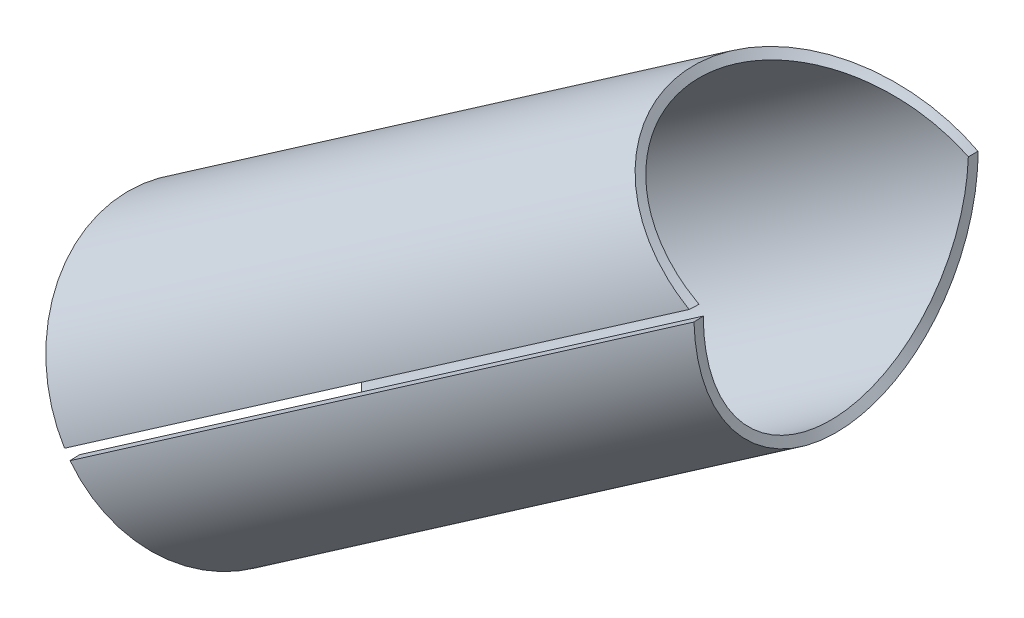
ISO-10303-21;
HEADER;
FILE_DESCRIPTION(('STEP AP214'),'2;1');
FILE_NAME('part.step','',(''),(''),'','','');
FILE_SCHEMA(('AUTOMOTIVE_DESIGN { 1 0 10303 214 1 1 1 1 }'));
ENDSEC;
DATA;
#1=APPLICATION_CONTEXT('core data for automotive mechanical design processes');
#2=APPLICATION_PROTOCOL_DEFINITION('international standard','automotive_design',2000,#1);
#3=PRODUCT_CONTEXT('',#1,'mechanical');
#4=PRODUCT('Part','Part','',(#3));
#5=PRODUCT_RELATED_PRODUCT_CATEGORY('part','',(#4));
#6=PRODUCT_DEFINITION_FORMATION('','',#4);
#7=PRODUCT_DEFINITION_CONTEXT('part definition',#1,'design');
#8=PRODUCT_DEFINITION('design','',#6,#7);
#9=PRODUCT_DEFINITION_SHAPE('','',#8);
#10=(LENGTH_UNIT() NAMED_UNIT(*) SI_UNIT(.MILLI.,.METRE.));
#11=(NAMED_UNIT(*) PLANE_ANGLE_UNIT() SI_UNIT($,.RADIAN.));
#12=(NAMED_UNIT(*) SI_UNIT($,.STERADIAN.) SOLID_ANGLE_UNIT());
#13=UNCERTAINTY_MEASURE_WITH_UNIT(LENGTH_MEASURE(1.E-05),#10,'distance_accuracy_value','');
#14=(GEOMETRIC_REPRESENTATION_CONTEXT(3) GLOBAL_UNCERTAINTY_ASSIGNED_CONTEXT((#13)) GLOBAL_UNIT_ASSIGNED_CONTEXT((#10,
#11,#12)) REPRESENTATION_CONTEXT('',''));
#15=CARTESIAN_POINT('',(0.,0.,0.));
#16=DIRECTION('',(0.,0.,1.));
#17=DIRECTION('',(1.,0.,0.));
#18=AXIS2_PLACEMENT_3D('',#15,#16,#17);
#19=CARTESIAN_POINT('',(-0.499999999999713,0.261949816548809,14.6683564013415));
#20=CARTESIAN_POINT('',(-1.03427774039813,0.541893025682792,14.6501434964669));
#21=CARTESIAN_POINT('',(-1.51605350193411,0.794596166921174,14.6047467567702));
#22=CARTESIAN_POINT('',(-2.37377469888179,1.24394241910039,14.4900592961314));
#23=CARTESIAN_POINT('',(-2.7497042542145,1.4406270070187,14.4207825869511));
#24=CARTESIAN_POINT('',(-3.15408911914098,1.65241661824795,14.3342000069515));
#25=CARTESIAN_POINT('',(-3.23176083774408,1.69311341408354,14.31687152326));
#26=CARTESIAN_POINT('',(-3.38742239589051,1.7746733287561,14.2808406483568));
#27=CARTESIAN_POINT('',(-3.46455492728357,1.81509122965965,14.2623165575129));
#28=CARTESIAN_POINT('',(-3.6938513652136,1.93524950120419,14.2053054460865));
#29=CARTESIAN_POINT('',(-3.84391368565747,2.01389381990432,14.1653800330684));
#30=CARTESIAN_POINT('',(-4.28565951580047,2.24539232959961,14.0405311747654));
#31=CARTESIAN_POINT('',(-4.56889596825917,2.39380351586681,13.950542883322));
#32=CARTESIAN_POINT('',(-5.11281457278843,2.67873626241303,13.7605108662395));
#33=CARTESIAN_POINT('',(-5.37349793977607,2.81525957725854,13.6604676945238));
#34=CARTESIAN_POINT('',(-5.87245514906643,3.07662566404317,13.4535281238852));
#35=CARTESIAN_POINT('',(-6.11316013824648,3.20275145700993,13.3456792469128));
#36=CARTESIAN_POINT('',(-6.81793295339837,3.57202081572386,13.0075686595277));
#37=CARTESIAN_POINT('',(-7.26087454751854,3.80405046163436,12.7643139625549));
#38=CARTESIAN_POINT('',(-7.88499785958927,4.13097307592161,12.3813056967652));
#39=CARTESIAN_POINT('',(-8.0858587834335,4.23620421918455,12.2509294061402));
#40=CARTESIAN_POINT('',(-8.47674296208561,4.44102207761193,11.9837692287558));
#41=CARTESIAN_POINT('',(-8.66702830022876,4.54073026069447,11.8467743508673));
#42=CARTESIAN_POINT('',(-9.22237454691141,4.83169550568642,11.4268314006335));
#43=CARTESIAN_POINT('',(-9.57191100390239,5.01477205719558,11.1349409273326));
#44=CARTESIAN_POINT('',(-10.2297649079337,5.35936973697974,10.5338081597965));
#45=CARTESIAN_POINT('',(-10.5376027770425,5.52071119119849,10.2252596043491));
#46=CARTESIAN_POINT('',(-11.1217614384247,5.82707888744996,9.58631226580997));
#47=CARTESIAN_POINT('',(-11.3968870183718,5.97141668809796,9.256941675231));
#48=CARTESIAN_POINT('',(-12.1710090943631,6.37732378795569,8.24500607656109));
#49=CARTESIAN_POINT('',(-12.6186467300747,6.61163630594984,7.5387135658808));
#50=CARTESIAN_POINT('',(-13.187921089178,6.90936506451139,6.45379169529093));
#51=CARTESIAN_POINT('',(-13.3606760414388,6.99969056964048,6.0878813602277));
#52=CARTESIAN_POINT('',(-13.6725549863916,7.16304886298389,5.35088506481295));
#53=CARTESIAN_POINT('',(-13.8126142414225,7.23654952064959,4.97771468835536));
#54=CARTESIAN_POINT('',(-14.4352972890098,7.56338869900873,3.0895739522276));
#55=CARTESIAN_POINT('',(-14.6813449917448,7.69175467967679,1.51385726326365));
#56=CARTESIAN_POINT('',(-14.6756582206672,7.68854121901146,-0.433843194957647));
#57=CARTESIAN_POINT('',(-14.6589586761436,7.67987441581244,-0.823000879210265));
#58=CARTESIAN_POINT('',(-14.5941291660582,7.64614862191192,-1.60252277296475));
#59=CARTESIAN_POINT('',(-14.5460023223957,7.62107994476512,-1.99223912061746));
#60=CARTESIAN_POINT('',(-14.3542405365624,7.5209027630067,-3.15738802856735));
#61=CARTESIAN_POINT('',(-14.1631599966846,7.42073018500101,-3.92884152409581));
#62=CARTESIAN_POINT('',(-13.7818123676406,7.22058056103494,-5.06206826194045));
#63=CARTESIAN_POINT('',(-13.6389245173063,7.14557175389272,-5.43581208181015));
#64=CARTESIAN_POINT('',(-13.3218231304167,6.97928481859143,-6.17259035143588));
#65=CARTESIAN_POINT('',(-13.1476236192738,6.88805199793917,-6.53573080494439));
#66=CARTESIAN_POINT('',(-12.5742834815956,6.58775071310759,-7.61302317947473));
#67=CARTESIAN_POINT('',(-12.1254624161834,6.35253985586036,-8.31221973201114));
#68=CARTESIAN_POINT('',(-11.3526046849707,5.94759175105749,-9.31166132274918));
#69=CARTESIAN_POINT('',(-11.0788155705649,5.80423027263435,-9.63616781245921));
#70=CARTESIAN_POINT('',(-10.4938505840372,5.49782418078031,-10.2700557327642));
#71=CARTESIAN_POINT('',(-10.1835266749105,5.33519561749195,-10.5784350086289));
#72=CARTESIAN_POINT('',(-9.52462585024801,4.98992827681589,-11.1754260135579));
#73=CARTESIAN_POINT('',(-9.17347287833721,4.80605869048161,-11.4662187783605));
#74=CARTESIAN_POINT('',(-8.42731374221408,4.41520058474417,-12.0252444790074));
#75=CARTESIAN_POINT('',(-8.03315996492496,4.20863351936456,-12.2929697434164));
#76=CARTESIAN_POINT('',(-7.19751404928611,3.7707574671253,-12.8002190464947));
#77=CARTESIAN_POINT('',(-6.75038744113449,3.53659916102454,-13.0430114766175));
#78=CARTESIAN_POINT('',(-6.03537810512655,3.16200567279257,-13.3810936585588));
#79=CARTESIAN_POINT('',(-5.7896638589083,3.03326117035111,-13.4894248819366));
#80=CARTESIAN_POINT('',(-5.41006963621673,2.83438773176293,-13.6440467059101));
#81=CARTESIAN_POINT('',(-5.28217948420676,2.76738747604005,-13.6940983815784));
#82=CARTESIAN_POINT('',(-5.02027660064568,2.63020659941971,-13.7922568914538));
#83=CARTESIAN_POINT('',(-4.88595232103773,2.55986027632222,-13.8404634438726));
#84=CARTESIAN_POINT('',(-4.1973905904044,2.19923927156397,-14.0758599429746));
#85=CARTESIAN_POINT('',(-3.5921666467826,1.88205741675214,-14.2463770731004));
#86=CARTESIAN_POINT('',(-2.85037109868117,1.49332219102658,-14.3976760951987));
#87=CARTESIAN_POINT('',(-2.76710619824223,1.44969046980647,-14.4139203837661));
#88=CARTESIAN_POINT('',(-2.59889625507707,1.36155814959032,-14.4451980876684));
#89=CARTESIAN_POINT('',(-2.51049320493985,1.31526755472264,-14.4608930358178));
#90=CARTESIAN_POINT('',(-2.22331691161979,1.16495084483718,-14.5087771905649));
#91=CARTESIAN_POINT('',(-2.00634307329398,1.05142408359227,-14.5411136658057));
#92=CARTESIAN_POINT('',(-1.2784017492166,0.670245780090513,-14.6292240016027));
#93=CARTESIAN_POINT('',(-0.690307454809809,0.361658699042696,-14.6768756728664));
#94=CARTESIAN_POINT('',(0.,1.86879316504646E-13,-14.6768756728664));
#95=CARTESIAN_POINT('',(-0.480606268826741,0.233941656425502,13.6689368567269));
#96=CARTESIAN_POINT('',(-0.994157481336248,0.483953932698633,13.651964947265));
#97=CARTESIAN_POINT('',(-1.45723890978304,0.70965694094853,13.6096612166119));
#98=CARTESIAN_POINT('',(-2.28169171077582,1.11095743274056,13.5027879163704));
#99=CARTESIAN_POINT('',(-2.64304835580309,1.28659602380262,13.4382313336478));
#100=CARTESIAN_POINT('',(-3.03175030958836,1.47573659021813,13.3575480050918));
#101=CARTESIAN_POINT('',(-3.10640919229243,1.51208228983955,13.3414001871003));
#102=CARTESIAN_POINT('',(-3.25603275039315,1.58492220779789,13.3078242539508));
#103=CARTESIAN_POINT('',(-3.3301732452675,1.62101905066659,13.2905622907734));
#104=CARTESIAN_POINT('',(-3.5505749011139,1.72833160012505,13.2374355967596));
#105=CARTESIAN_POINT('',(-3.69481583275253,1.79856874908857,13.2002304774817));
#106=CARTESIAN_POINT('',(-4.119425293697,2.00531914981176,13.0838881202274));
#107=CARTESIAN_POINT('',(-4.39167496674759,2.13786338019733,13.000031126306));
#108=CARTESIAN_POINT('',(-4.91449717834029,2.39232900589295,12.8229468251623));
#109=CARTESIAN_POINT('',(-5.16507084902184,2.51425203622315,12.7297200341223));
#110=CARTESIAN_POINT('',(-5.64467596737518,2.74767009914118,12.5368801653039));
#111=CARTESIAN_POINT('',(-5.87604396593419,2.86031153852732,12.4363795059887));
#112=CARTESIAN_POINT('',(-6.55347918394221,3.19010031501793,12.1213058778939));
#113=CARTESIAN_POINT('',(-6.97924106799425,3.39731925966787,11.8946251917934));
#114=CARTESIAN_POINT('',(-7.57915798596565,3.68928333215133,11.537712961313));
#115=CARTESIAN_POINT('',(-7.77222801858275,3.78326297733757,11.4162197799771));
#116=CARTESIAN_POINT('',(-8.14794971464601,3.96618338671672,11.1672623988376));
#117=CARTESIAN_POINT('',(-8.33085380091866,4.05523166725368,11.0396015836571));
#118=CARTESIAN_POINT('',(-8.86465895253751,4.31508755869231,10.6482711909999));
#119=CARTESIAN_POINT('',(-9.20063922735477,4.47858645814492,10.3762684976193));
#120=CARTESIAN_POINT('',(-9.83297829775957,4.78633596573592,9.81609354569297));
#121=CARTESIAN_POINT('',(-10.128873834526,4.93043046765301,9.52856775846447));
#122=CARTESIAN_POINT('',(-10.6903640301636,5.20406067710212,8.93315470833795));
#123=CARTESIAN_POINT('',(-10.9548118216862,5.33297776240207,8.6262255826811));
#124=CARTESIAN_POINT('',(-11.698896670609,5.69550551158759,7.68323760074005));
#125=CARTESIAN_POINT('',(-12.1291781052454,5.90475244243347,7.0250679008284));
#126=CARTESIAN_POINT('',(-12.6763881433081,6.1706162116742,6.01406652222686));
#127=CARTESIAN_POINT('',(-12.8424481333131,6.25127294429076,5.67308726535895));
#128=CARTESIAN_POINT('',(-13.1422312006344,6.39716253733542,4.98630576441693));
#129=CARTESIAN_POINT('',(-13.2768539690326,6.46281189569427,4.63856112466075));
#130=CARTESIAN_POINT('',(-13.8753650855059,6.75474230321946,2.87906770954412));
#131=CARTESIAN_POINT('',(-14.1118863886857,6.86935038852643,1.41071151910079));
#132=CARTESIAN_POINT('',(-14.1064276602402,6.8664662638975,-0.404283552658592));
#133=CARTESIAN_POINT('',(-14.0903732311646,6.85873112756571,-0.76692621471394));
#134=CARTESIAN_POINT('',(-14.0280506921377,6.8286258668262,-1.49333585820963));
#135=CARTESIAN_POINT('',(-13.9817859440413,6.80624640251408,-1.85649911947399));
#136=CARTESIAN_POINT('',(-13.7974529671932,6.71679780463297,-2.94226131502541));
#137=CARTESIAN_POINT('',(-13.6137860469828,6.62733187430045,-3.66115229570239));
#138=CARTESIAN_POINT('',(-13.247241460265,6.44856060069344,-4.71716731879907));
#139=CARTESIAN_POINT('',(-13.1099006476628,6.38156274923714,-5.06544633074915));
#140=CARTESIAN_POINT('',(-12.8051038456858,6.23304592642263,-5.75202466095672));
#141=CARTESIAN_POINT('',(-12.6376601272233,6.15156972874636,-6.09042276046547));
#142=CARTESIAN_POINT('',(-12.0865561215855,5.88338156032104,-7.09431447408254));
#143=CARTESIAN_POINT('',(-11.655146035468,5.67331540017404,-7.74587169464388));
#144=CARTESIAN_POINT('',(-10.9122670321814,5.3116621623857,-8.67721694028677));
#145=CARTESIAN_POINT('',(-10.6490950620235,5.18363381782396,-8.97961337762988));
#146=CARTESIAN_POINT('',(-10.0868175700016,4.9099926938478,-9.57031172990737));
#147=CARTESIAN_POINT('',(-9.78853193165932,4.76474963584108,-9.85767977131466));
#148=CARTESIAN_POINT('',(-9.15519041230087,4.4563946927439,-10.4139951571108));
#149=CARTESIAN_POINT('',(-8.81765460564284,4.29219082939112,-10.6849749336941));
#150=CARTESIAN_POINT('',(-8.10043535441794,3.94312730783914,-11.2059117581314));
#151=CARTESIAN_POINT('',(-7.72157203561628,3.75864251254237,-11.4553957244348));
#152=CARTESIAN_POINT('',(-6.91834130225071,3.36758002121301,-11.9280839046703));
#153=CARTESIAN_POINT('',(-6.48855469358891,3.15846390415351,-12.1543338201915));
#154=CARTESIAN_POINT('',(-5.80127876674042,2.82392262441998,-12.4693809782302));
#155=CARTESIAN_POINT('',(-5.565095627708,2.70894281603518,-12.5703311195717));
#156=CARTESIAN_POINT('',(-5.20022503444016,2.53133304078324,-12.7144178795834));
#157=CARTESIAN_POINT('',(-5.0772953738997,2.47149665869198,-12.7610593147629));
#158=CARTESIAN_POINT('',(-4.82555008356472,2.3489852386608,-12.8525298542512));
#159=CARTESIAN_POINT('',(-4.69643506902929,2.28616206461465,-12.8974518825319));
#160=CARTESIAN_POINT('',(-4.03457719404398,1.96410640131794,-13.1168097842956));
#161=CARTESIAN_POINT('',(-3.45283170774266,1.6808318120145,-13.2757088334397));
#162=CARTESIAN_POINT('',(-2.7398119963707,1.33365425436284,-13.4166991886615));
#163=CARTESIAN_POINT('',(-2.65977702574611,1.2946871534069,-13.4318366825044));
#164=CARTESIAN_POINT('',(-2.49809174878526,1.21597766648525,-13.4609832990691));
#165=CARTESIAN_POINT('',(-2.4131168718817,1.17463799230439,-13.4756088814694));
#166=CARTESIAN_POINT('',(-2.13707511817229,1.0404016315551,-13.5202304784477));
#167=CARTESIAN_POINT('',(-1.92851249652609,0.939022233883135,-13.5503637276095));
#168=CARTESIAN_POINT('',(-1.22880011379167,0.598611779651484,-13.6324707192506));
#169=CARTESIAN_POINT('',(-0.663525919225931,0.322986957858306,-13.6768756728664));
#170=CARTESIAN_POINT('',(0.,1.78761797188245E-13,-13.6768756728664));
#171=B_SPLINE_SURFACE_WITH_KNOTS('',1,3,((#19,#20,#21,#22,#23,#24,#25,#26,#27,#28,#29,#30,#31,
#32,#33,#34,#35,#36,#37,#38,#39,#40,#41,#42,#43,#44,#45,#46,#47,#48,#49,#50,#51,#52,#53,#54,#55,
#56,#57,#58,#59,#60,#61,#62,#63,#64,#65,#66,#67,#68,#69,#70,#71,#72,#73,#74,#75,#76,#77,#78,#79,
#80,#81,#82,#83,#84,#85,#86,#87,#88,#89,#90,#91,#92,#93,#94),(#95,#96,#97,#98,#99,#100,#101,
#102,#103,#104,#105,#106,#107,#108,#109,#110,#111,#112,#113,#114,#115,#116,#117,#118,#119,#120,
#121,#122,#123,#124,#125,#126,#127,#128,#129,#130,#131,#132,#133,#134,#135,#136,#137,#138,#139,
#140,#141,#142,#143,#144,#145,#146,#147,#148,#149,#150,#151,#152,#153,#154,#155,#156,#157,#158,
#159,#160,#161,#162,#163,#164,#165,#166,#167,#168,#169,#170)),.UNSPECIFIED.,.F.,.F.,.F.,(2,2),
(4,2,2,2,2,2,2,2,2,2,2,2,2,2,2,2,2,2,2,2,2,2,2,2,2,2,2,2,2,2,2,2,2,2,2,2,2,4),(0.,1.),(0.,
0.015625,0.03125,0.03515625,0.0390625,0.046875,0.0625,0.078125,0.09375,0.125,0.140625,0.15625,
0.1875,0.21875,0.25,0.3125,0.34375,0.375,0.5,0.53125,0.5625,0.625,0.65625,0.6875,0.75,0.78125,
0.8125,0.84375,0.875,0.90625,0.921875,0.9296875,0.9375,0.96875,0.97265625,0.9765625,0.984375,
1.),.UNSPECIFIED.);
#172=CARTESIAN_POINT('',(-0.499999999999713,0.261949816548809,14.6683564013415));
#173=CARTESIAN_POINT('',(-0.480606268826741,0.233941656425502,13.6689368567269));
#174=B_SPLINE_CURVE_WITH_KNOTS('',1,(#172,#173),.UNSPECIFIED.,.F.,.F.,(2,2),(0.,1.),.UNSPECIFIED.);
#175=CARTESIAN_POINT('',(-0.480606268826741,0.233941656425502,13.6689368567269));
#176=VERTEX_POINT('',#175);
#177=CARTESIAN_POINT('',(-0.499999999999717,0.261949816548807,14.6683564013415));
#178=VERTEX_POINT('',#177);
#179=EDGE_CURVE('E13',#176,#178,#174,.F.);
#180=CARTESIAN_POINT('',(-0.480606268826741,0.233941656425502,13.6689368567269));
#181=CARTESIAN_POINT('',(-0.994157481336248,0.483953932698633,13.651964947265));
#182=CARTESIAN_POINT('',(-1.45723890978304,0.70965694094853,13.6096612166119));
#183=CARTESIAN_POINT('',(-2.28169171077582,1.11095743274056,13.5027879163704));
#184=CARTESIAN_POINT('',(-2.64304835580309,1.28659602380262,13.4382313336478));
#185=CARTESIAN_POINT('',(-3.03175030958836,1.47573659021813,13.3575480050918));
#186=CARTESIAN_POINT('',(-3.10640919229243,1.51208228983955,13.3414001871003));
#187=CARTESIAN_POINT('',(-3.25603275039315,1.58492220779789,13.3078242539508));
#188=CARTESIAN_POINT('',(-3.3301732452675,1.62101905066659,13.2905622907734));
#189=CARTESIAN_POINT('',(-3.5505749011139,1.72833160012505,13.2374355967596));
#190=CARTESIAN_POINT('',(-3.69481583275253,1.79856874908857,13.2002304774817));
#191=CARTESIAN_POINT('',(-4.119425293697,2.00531914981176,13.0838881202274));
#192=CARTESIAN_POINT('',(-4.39167496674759,2.13786338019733,13.000031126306));
#193=CARTESIAN_POINT('',(-4.91449717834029,2.39232900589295,12.8229468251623));
#194=CARTESIAN_POINT('',(-5.16507084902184,2.51425203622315,12.7297200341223));
#195=CARTESIAN_POINT('',(-5.64467596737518,2.74767009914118,12.5368801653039));
#196=CARTESIAN_POINT('',(-5.87604396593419,2.86031153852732,12.4363795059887));
#197=CARTESIAN_POINT('',(-6.55347918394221,3.19010031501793,12.1213058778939));
#198=CARTESIAN_POINT('',(-6.97924106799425,3.39731925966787,11.8946251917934));
#199=CARTESIAN_POINT('',(-7.57915798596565,3.68928333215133,11.537712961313));
#200=CARTESIAN_POINT('',(-7.77222801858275,3.78326297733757,11.4162197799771));
#201=CARTESIAN_POINT('',(-8.14794971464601,3.96618338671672,11.1672623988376));
#202=CARTESIAN_POINT('',(-8.33085380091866,4.05523166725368,11.0396015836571));
#203=CARTESIAN_POINT('',(-8.86465895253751,4.31508755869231,10.6482711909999));
#204=CARTESIAN_POINT('',(-9.20063922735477,4.47858645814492,10.3762684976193));
#205=CARTESIAN_POINT('',(-9.83297829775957,4.78633596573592,9.81609354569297));
#206=CARTESIAN_POINT('',(-10.128873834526,4.93043046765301,9.52856775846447));
#207=CARTESIAN_POINT('',(-10.6903640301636,5.20406067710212,8.93315470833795));
#208=CARTESIAN_POINT('',(-10.9548118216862,5.33297776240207,8.6262255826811));
#209=CARTESIAN_POINT('',(-11.698896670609,5.69550551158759,7.68323760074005));
#210=CARTESIAN_POINT('',(-12.1291781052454,5.90475244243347,7.0250679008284));
#211=CARTESIAN_POINT('',(-12.6763881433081,6.1706162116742,6.01406652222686));
#212=CARTESIAN_POINT('',(-12.8424481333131,6.25127294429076,5.67308726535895));
#213=CARTESIAN_POINT('',(-13.1422312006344,6.39716253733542,4.98630576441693));
#214=CARTESIAN_POINT('',(-13.2768539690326,6.46281189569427,4.63856112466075));
#215=CARTESIAN_POINT('',(-13.8753650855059,6.75474230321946,2.87906770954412));
#216=CARTESIAN_POINT('',(-14.1118863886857,6.86935038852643,1.41071151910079));
#217=CARTESIAN_POINT('',(-14.1064276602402,6.8664662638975,-0.404283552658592));
#218=CARTESIAN_POINT('',(-14.0903732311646,6.85873112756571,-0.76692621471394));
#219=CARTESIAN_POINT('',(-14.0280506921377,6.8286258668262,-1.49333585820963));
#220=CARTESIAN_POINT('',(-13.9817859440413,6.80624640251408,-1.85649911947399));
#221=CARTESIAN_POINT('',(-13.7974529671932,6.71679780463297,-2.94226131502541));
#222=CARTESIAN_POINT('',(-13.6137860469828,6.62733187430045,-3.66115229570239));
#223=CARTESIAN_POINT('',(-13.247241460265,6.44856060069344,-4.71716731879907));
#224=CARTESIAN_POINT('',(-13.1099006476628,6.38156274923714,-5.06544633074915));
#225=CARTESIAN_POINT('',(-12.8051038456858,6.23304592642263,-5.75202466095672));
#226=CARTESIAN_POINT('',(-12.6376601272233,6.15156972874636,-6.09042276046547));
#227=CARTESIAN_POINT('',(-12.0865561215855,5.88338156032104,-7.09431447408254));
#228=CARTESIAN_POINT('',(-11.655146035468,5.67331540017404,-7.74587169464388));
#229=CARTESIAN_POINT('',(-10.9122670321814,5.3116621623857,-8.67721694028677));
#230=CARTESIAN_POINT('',(-10.6490950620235,5.18363381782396,-8.97961337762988));
#231=CARTESIAN_POINT('',(-10.0868175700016,4.9099926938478,-9.57031172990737));
#232=CARTESIAN_POINT('',(-9.78853193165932,4.76474963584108,-9.85767977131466));
#233=CARTESIAN_POINT('',(-9.15519041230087,4.4563946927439,-10.4139951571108));
#234=CARTESIAN_POINT('',(-8.81765460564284,4.29219082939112,-10.6849749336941));
#235=CARTESIAN_POINT('',(-8.10043535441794,3.94312730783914,-11.2059117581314));
#236=CARTESIAN_POINT('',(-7.72157203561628,3.75864251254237,-11.4553957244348));
#237=CARTESIAN_POINT('',(-6.91834130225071,3.36758002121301,-11.9280839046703));
#238=CARTESIAN_POINT('',(-6.48855469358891,3.15846390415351,-12.1543338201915));
#239=CARTESIAN_POINT('',(-5.80127876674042,2.82392262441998,-12.4693809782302));
#240=CARTESIAN_POINT('',(-5.565095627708,2.70894281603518,-12.5703311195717));
#241=CARTESIAN_POINT('',(-5.20022503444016,2.53133304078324,-12.7144178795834));
#242=CARTESIAN_POINT('',(-5.0772953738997,2.47149665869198,-12.7610593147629));
#243=CARTESIAN_POINT('',(-4.82555008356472,2.3489852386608,-12.8525298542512));
#244=CARTESIAN_POINT('',(-4.69643506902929,2.28616206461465,-12.8974518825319));
#245=CARTESIAN_POINT('',(-4.03457719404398,1.96410640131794,-13.1168097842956));
#246=CARTESIAN_POINT('',(-3.45283170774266,1.6808318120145,-13.2757088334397));
#247=CARTESIAN_POINT('',(-2.7398119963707,1.33365425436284,-13.4166991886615));
#248=CARTESIAN_POINT('',(-2.65977702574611,1.2946871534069,-13.4318366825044));
#249=CARTESIAN_POINT('',(-2.49809174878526,1.21597766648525,-13.4609832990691));
#250=CARTESIAN_POINT('',(-2.4131168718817,1.17463799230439,-13.4756088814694));
#251=CARTESIAN_POINT('',(-2.13707511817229,1.0404016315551,-13.5202304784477));
#252=CARTESIAN_POINT('',(-1.92851249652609,0.939022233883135,-13.5503637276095));
#253=CARTESIAN_POINT('',(-1.22880011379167,0.598611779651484,-13.6324707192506));
#254=CARTESIAN_POINT('',(-0.663525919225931,0.322986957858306,-13.6768756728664));
#255=CARTESIAN_POINT('',(0.,1.78761797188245E-13,-13.6768756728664));
#256=B_SPLINE_CURVE_WITH_KNOTS('',3,(#180,#181,#182,#183,#184,#185,#186,#187,#188,#189,#190,
#191,#192,#193,#194,#195,#196,#197,#198,#199,#200,#201,#202,#203,#204,#205,#206,#207,#208,#209,
#210,#211,#212,#213,#214,#215,#216,#217,#218,#219,#220,#221,#222,#223,#224,#225,#226,#227,#228,
#229,#230,#231,#232,#233,#234,#235,#236,#237,#238,#239,#240,#241,#242,#243,#244,#245,#246,#247,
#248,#249,#250,#251,#252,#253,#254,#255),.UNSPECIFIED.,.F.,.F.,(4,2,2,2,2,2,2,2,2,2,2,2,2,2,2,2,
2,2,2,2,2,2,2,2,2,2,2,2,2,2,2,2,2,2,2,2,2,4),(0.,0.015625,0.03125,0.03515625,0.0390625,0.046875,
0.0625,0.078125,0.09375,0.125,0.140625,0.15625,0.1875,0.21875,0.25,0.3125,0.34375,0.375,0.5,
0.53125,0.5625,0.625,0.65625,0.6875,0.75,0.78125,0.8125,0.84375,0.875,0.90625,0.921875,
0.9296875,0.9375,0.96875,0.97265625,0.9765625,0.984375,1.),.UNSPECIFIED.);
#257=CARTESIAN_POINT('',(0.,1.84858021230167E-13,-13.6768756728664));
#258=VERTEX_POINT('',#257);
#259=EDGE_CURVE('E165',#176,#258,#256,.T.);
#260=CARTESIAN_POINT('',(0.,1.78761797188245E-13,-13.6768756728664));
#261=CARTESIAN_POINT('',(0.,1.86879316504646E-13,-14.6768756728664));
#262=B_SPLINE_CURVE_WITH_KNOTS('',1,(#260,#261),.UNSPECIFIED.,.F.,.F.,(2,2),(0.,1.),.UNSPECIFIED.);
#263=CARTESIAN_POINT('',(-4.11096626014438E-07,2.15377680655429E-07,-14.6768756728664));
#264=VERTEX_POINT('',#263);
#265=EDGE_CURVE('E49',#258,#264,#262,.T.);
#266=CARTESIAN_POINT('',(0.,1.86879316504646E-13,-14.6768756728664));
#267=CARTESIAN_POINT('',(-0.690307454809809,0.361658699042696,-14.6768756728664));
#268=CARTESIAN_POINT('',(-1.2784017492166,0.670245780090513,-14.6292240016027));
#269=CARTESIAN_POINT('',(-2.00634307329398,1.05142408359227,-14.5411136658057));
#270=CARTESIAN_POINT('',(-2.22331691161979,1.16495084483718,-14.5087771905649));
#271=CARTESIAN_POINT('',(-2.51049320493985,1.31526755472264,-14.4608930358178));
#272=CARTESIAN_POINT('',(-2.59889625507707,1.36155814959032,-14.4451980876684));
#273=CARTESIAN_POINT('',(-2.76710619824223,1.44969046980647,-14.4139203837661));
#274=CARTESIAN_POINT('',(-2.85037109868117,1.49332219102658,-14.3976760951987));
#275=CARTESIAN_POINT('',(-3.5921666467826,1.88205741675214,-14.2463770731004));
#276=CARTESIAN_POINT('',(-4.1973905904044,2.19923927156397,-14.0758599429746));
#277=CARTESIAN_POINT('',(-4.88595232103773,2.55986027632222,-13.8404634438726));
#278=CARTESIAN_POINT('',(-5.02027660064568,2.63020659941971,-13.7922568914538));
#279=CARTESIAN_POINT('',(-5.28217948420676,2.76738747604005,-13.6940983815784));
#280=CARTESIAN_POINT('',(-5.41006963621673,2.83438773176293,-13.6440467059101));
#281=CARTESIAN_POINT('',(-5.7896638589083,3.03326117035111,-13.4894248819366));
#282=CARTESIAN_POINT('',(-6.03537810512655,3.16200567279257,-13.3810936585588));
#283=CARTESIAN_POINT('',(-6.75038744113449,3.53659916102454,-13.0430114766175));
#284=CARTESIAN_POINT('',(-7.19751404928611,3.7707574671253,-12.8002190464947));
#285=CARTESIAN_POINT('',(-8.03315996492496,4.20863351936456,-12.2929697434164));
#286=CARTESIAN_POINT('',(-8.42731374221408,4.41520058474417,-12.0252444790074));
#287=CARTESIAN_POINT('',(-9.17347287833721,4.80605869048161,-11.4662187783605));
#288=CARTESIAN_POINT('',(-9.52462585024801,4.98992827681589,-11.1754260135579));
#289=CARTESIAN_POINT('',(-10.1835266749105,5.33519561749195,-10.5784350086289));
#290=CARTESIAN_POINT('',(-10.4938505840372,5.49782418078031,-10.2700557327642));
#291=CARTESIAN_POINT('',(-11.0788155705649,5.80423027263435,-9.63616781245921));
#292=CARTESIAN_POINT('',(-11.3526046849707,5.94759175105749,-9.31166132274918));
#293=CARTESIAN_POINT('',(-12.1254624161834,6.35253985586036,-8.31221973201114));
#294=CARTESIAN_POINT('',(-12.5742834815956,6.58775071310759,-7.61302317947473));
#295=CARTESIAN_POINT('',(-13.1476236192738,6.88805199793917,-6.53573080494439));
#296=CARTESIAN_POINT('',(-13.3218231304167,6.97928481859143,-6.17259035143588));
#297=CARTESIAN_POINT('',(-13.6389245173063,7.14557175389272,-5.43581208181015));
#298=CARTESIAN_POINT('',(-13.7818123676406,7.22058056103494,-5.06206826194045));
#299=CARTESIAN_POINT('',(-14.1631599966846,7.42073018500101,-3.92884152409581));
#300=CARTESIAN_POINT('',(-14.3542405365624,7.5209027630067,-3.15738802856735));
#301=CARTESIAN_POINT('',(-14.5460023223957,7.62107994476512,-1.99223912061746));
#302=CARTESIAN_POINT('',(-14.5941291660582,7.64614862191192,-1.60252277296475));
#303=CARTESIAN_POINT('',(-14.6589586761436,7.67987441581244,-0.823000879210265));
#304=CARTESIAN_POINT('',(-14.6756582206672,7.68854121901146,-0.433843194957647));
#305=CARTESIAN_POINT('',(-14.6813449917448,7.69175467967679,1.51385726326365));
#306=CARTESIAN_POINT('',(-14.4352972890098,7.56338869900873,3.0895739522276));
#307=CARTESIAN_POINT('',(-13.8126142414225,7.23654952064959,4.97771468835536));
#308=CARTESIAN_POINT('',(-13.6725549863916,7.16304886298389,5.35088506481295));
#309=CARTESIAN_POINT('',(-13.3606760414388,6.99969056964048,6.0878813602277));
#310=CARTESIAN_POINT('',(-13.187921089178,6.90936506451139,6.45379169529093));
#311=CARTESIAN_POINT('',(-12.6186467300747,6.61163630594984,7.5387135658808));
#312=CARTESIAN_POINT('',(-12.1710090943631,6.37732378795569,8.24500607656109));
#313=CARTESIAN_POINT('',(-11.3968870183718,5.97141668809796,9.256941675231));
#314=CARTESIAN_POINT('',(-11.1217614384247,5.82707888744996,9.58631226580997));
#315=CARTESIAN_POINT('',(-10.5376027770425,5.52071119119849,10.2252596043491));
#316=CARTESIAN_POINT('',(-10.2297649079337,5.35936973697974,10.5338081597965));
#317=CARTESIAN_POINT('',(-9.57191100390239,5.01477205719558,11.1349409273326));
#318=CARTESIAN_POINT('',(-9.22237454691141,4.83169550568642,11.4268314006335));
#319=CARTESIAN_POINT('',(-8.66702830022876,4.54073026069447,11.8467743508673));
#320=CARTESIAN_POINT('',(-8.47674296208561,4.44102207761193,11.9837692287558));
#321=CARTESIAN_POINT('',(-8.0858587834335,4.23620421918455,12.2509294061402));
#322=CARTESIAN_POINT('',(-7.88499785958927,4.13097307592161,12.3813056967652));
#323=CARTESIAN_POINT('',(-7.26087454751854,3.80405046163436,12.7643139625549));
#324=CARTESIAN_POINT('',(-6.81793295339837,3.57202081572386,13.0075686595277));
#325=CARTESIAN_POINT('',(-6.11316013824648,3.20275145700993,13.3456792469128));
#326=CARTESIAN_POINT('',(-5.87245514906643,3.07662566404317,13.4535281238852));
#327=CARTESIAN_POINT('',(-5.37349793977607,2.81525957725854,13.6604676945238));
#328=CARTESIAN_POINT('',(-5.11281457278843,2.67873626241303,13.7605108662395));
#329=CARTESIAN_POINT('',(-4.56889596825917,2.39380351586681,13.950542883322));
#330=CARTESIAN_POINT('',(-4.28565951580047,2.24539232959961,14.0405311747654));
#331=CARTESIAN_POINT('',(-3.84391368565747,2.01389381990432,14.1653800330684));
#332=CARTESIAN_POINT('',(-3.6938513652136,1.93524950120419,14.2053054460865));
#333=CARTESIAN_POINT('',(-3.46455492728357,1.81509122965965,14.2623165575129));
#334=CARTESIAN_POINT('',(-3.38742239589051,1.7746733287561,14.2808406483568));
#335=CARTESIAN_POINT('',(-3.23176083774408,1.69311341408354,14.31687152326));
#336=CARTESIAN_POINT('',(-3.15408911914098,1.65241661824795,14.3342000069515));
#337=CARTESIAN_POINT('',(-2.7497042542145,1.4406270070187,14.4207825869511));
#338=CARTESIAN_POINT('',(-2.37377469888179,1.24394241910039,14.4900592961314));
#339=CARTESIAN_POINT('',(-1.51605350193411,0.794596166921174,14.6047467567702));
#340=CARTESIAN_POINT('',(-1.03427774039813,0.541893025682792,14.6501434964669));
#341=CARTESIAN_POINT('',(-0.499999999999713,0.261949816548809,14.6683564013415));
#342=B_SPLINE_CURVE_WITH_KNOTS('',3,(#266,#267,#268,#269,#270,#271,#272,#273,#274,#275,#276,
#277,#278,#279,#280,#281,#282,#283,#284,#285,#286,#287,#288,#289,#290,#291,#292,#293,#294,#295,
#296,#297,#298,#299,#300,#301,#302,#303,#304,#305,#306,#307,#308,#309,#310,#311,#312,#313,#314,
#315,#316,#317,#318,#319,#320,#321,#322,#323,#324,#325,#326,#327,#328,#329,#330,#331,#332,#333,
#334,#335,#336,#337,#338,#339,#340,#341),.UNSPECIFIED.,.F.,.F.,(4,2,2,2,2,2,2,2,2,2,2,2,2,2,2,2,
2,2,2,2,2,2,2,2,2,2,2,2,2,2,2,2,2,2,2,2,2,4),(0.,0.015625,0.0234375,0.02734375,0.03125,0.0625,
0.0703125,0.078125,0.09375,0.125,0.15625,0.1875,0.21875,0.25,0.3125,0.34375,0.375,0.4375,
0.46875,0.5,0.625,0.65625,0.6875,0.75,0.78125,0.8125,0.84375,0.859375,0.875,0.90625,0.921875,
0.9375,0.953125,0.9609375,0.96484375,0.96875,0.984375,1.),.UNSPECIFIED.);
#343=EDGE_CURVE('E114',#178,#264,#342,.F.);
#344=ORIENTED_EDGE('',*,*,#179,.F.);
#345=ORIENTED_EDGE('',*,*,#259,.T.);
#346=ORIENTED_EDGE('',*,*,#265,.T.);
#347=ORIENTED_EDGE('',*,*,#343,.F.);
#348=EDGE_LOOP('',(#344,#345,#346,#347));
#349=FACE_BOUND('',#348,.T.);
#350=ADVANCED_FACE('F38',(#349),#171,.T.);
#351=CARTESIAN_POINT('',(0.,1.95004920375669E-13,-14.6768756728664));
#352=CARTESIAN_POINT('',(5.44400377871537E-06,-0.863208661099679,-14.6768756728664));
#353=CARTESIAN_POINT('',(0.000499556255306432,-1.59094584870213,-14.6266512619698));
#354=CARTESIAN_POINT('',(0.000248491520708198,-2.4779047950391,-14.5368459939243));
#355=CARTESIAN_POINT('',(8.5470342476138E-05,-2.73951578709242,-14.5042673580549));
#356=CARTESIAN_POINT('',(-8.2649161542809E-06,-3.08125892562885,-14.4569157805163));
#357=CARTESIAN_POINT('',(-1.05643111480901E-06,-3.18520880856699,-14.4416334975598));
#358=CARTESIAN_POINT('',(1.07685321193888E-05,-3.39495752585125,-14.4092972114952));
#359=CARTESIAN_POINT('',(2.1191765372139E-05,-3.49869294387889,-14.3925039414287));
#360=CARTESIAN_POINT('',(0.000128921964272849,-4.42202271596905,-14.2361399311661));
#361=CARTESIAN_POINT('',(0.000109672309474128,-5.1692850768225,-14.0603062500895));
#362=CARTESIAN_POINT('',(1.28726589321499E-05,-6.01162158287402,-13.8204396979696));
#363=CARTESIAN_POINT('',(9.3029807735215E-06,-6.17481834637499,-13.7716667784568));
#364=CARTESIAN_POINT('',(1.86935457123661E-05,-6.49628927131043,-13.6713368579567));
#365=CARTESIAN_POINT('',(2.6938919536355E-05,-6.65458334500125,-13.6197489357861));
#366=CARTESIAN_POINT('',(4.52448168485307E-05,-7.12211673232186,-13.4611073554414));
#367=CARTESIAN_POINT('',(4.58193230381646E-05,-7.42400279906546,-13.3501792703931));
#368=CARTESIAN_POINT('',(1.05888252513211E-05,-8.00815026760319,-13.1199971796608));
#369=CARTESIAN_POINT('',(-2.47690305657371E-05,-8.29041231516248,-13.0007434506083));
#370=CARTESIAN_POINT('',(-5.16613653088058E-05,-8.83542757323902,-12.7558072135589));
#371=CARTESIAN_POINT('',(-5.98053416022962E-06,-9.09731191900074,-12.6305672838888));
#372=CARTESIAN_POINT('',(0.000119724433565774,-9.86181206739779,-12.243962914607));
#373=CARTESIAN_POINT('',(0.000101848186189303,-10.3432615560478,-11.9714859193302));
#374=CARTESIAN_POINT('',(3.04784782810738E-06,-11.0232261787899,-11.5469960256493));
#375=CARTESIAN_POINT('',(-3.64376877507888E-05,-11.2428539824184,-11.4028648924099));
#376=CARTESIAN_POINT('',(-5.53313713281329E-05,-11.6681611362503,-11.1103204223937));
#377=CARTESIAN_POINT('',(-7.34829017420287E-06,-11.8734894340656,-10.9621743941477));
#378=CARTESIAN_POINT('',(0.000144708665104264,-12.8728885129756,-10.2077201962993));
#379=CARTESIAN_POINT('',(-0.000137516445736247,-13.580633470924,-9.56308763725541));
#380=CARTESIAN_POINT('',(0.000110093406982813,-14.8166954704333,-8.22945551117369));
#381=CARTESIAN_POINT('',(2.76596670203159E-05,-15.3534793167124,-7.53172145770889));
#382=CARTESIAN_POINT('',(-2.62301973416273E-05,-16.0373318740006,-6.45983643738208));
#383=CARTESIAN_POINT('',(3.86575130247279E-05,-16.2450240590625,-6.09853106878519));
#384=CARTESIAN_POINT('',(9.31867450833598E-05,-16.622971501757,-5.36606619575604));
#385=CARTESIAN_POINT('',(9.15533565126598E-05,-16.7928576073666,-4.99542499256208));
#386=CARTESIAN_POINT('',(2.18014054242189E-05,-17.2452846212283,-3.87444096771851));
#387=CARTESIAN_POINT('',(4.09252852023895E-05,-17.4703277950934,-3.11653632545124));
#388=CARTESIAN_POINT('',(8.61012300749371E-05,-17.7726697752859,-1.5842329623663));
#389=CARTESIAN_POINT('',(4.53578405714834E-06,-17.8492903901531,-0.811535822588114));
#390=CARTESIAN_POINT('',(-7.76211677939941E-06,-17.8544573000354,0.730823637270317));
#391=CARTESIAN_POINT('',(8.97997674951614E-05,-17.7829079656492,1.50452377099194));
#392=CARTESIAN_POINT('',(2.01966297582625E-05,-17.4907800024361,3.03804938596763));
#393=CARTESIAN_POINT('',(2.8386563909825E-05,-17.2706050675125,3.79748263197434));
#394=CARTESIAN_POINT('',(6.85024953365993E-05,-16.8254274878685,4.92083721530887));
#395=CARTESIAN_POINT('',(5.5865843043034E-05,-16.6579818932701,5.29221670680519));
#396=CARTESIAN_POINT('',(-8.31339524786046E-06,-16.2850035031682,6.0260783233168));
#397=CARTESIAN_POINT('',(-3.33146024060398E-05,-16.079556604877,6.38851626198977));
#398=CARTESIAN_POINT('',(1.82610567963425E-05,-15.6280818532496,7.10551366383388));
#399=CARTESIAN_POINT('',(4.92259109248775E-05,-15.3823238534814,7.45955609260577));
#400=CARTESIAN_POINT('',(3.13865226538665E-05,-14.8506364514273,8.15538730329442));
#401=CARTESIAN_POINT('',(-4.27085918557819E-05,-14.5652707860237,8.49659439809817));
#402=CARTESIAN_POINT('',(-3.99988974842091E-05,-13.6449440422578,9.50093728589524));
#403=CARTESIAN_POINT('',(6.54120351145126E-05,-12.9434740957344,10.1468140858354));
#404=CARTESIAN_POINT('',(-8.939358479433E-05,-11.7575999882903,11.0529787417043));
#405=CARTESIAN_POINT('',(3.20088168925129E-05,-11.335850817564,11.3476829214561));
#406=CARTESIAN_POINT('',(0.000109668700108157,-10.4386986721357,11.9152575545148));
#407=CARTESIAN_POINT('',(3.15038544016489E-05,-9.96422649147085,12.1876581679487));
#408=CARTESIAN_POINT('',(-0.000110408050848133,-8.95779223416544,12.7048151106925));
#409=CARTESIAN_POINT('',(2.93937694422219E-05,-8.41831896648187,12.953271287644));
#410=CARTESIAN_POINT('',(5.40670756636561E-05,-7.55400107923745,13.300742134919));
#411=CARTESIAN_POINT('',(4.02418663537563E-05,-7.2567231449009,13.4123510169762));
#412=CARTESIAN_POINT('',(1.38235814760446E-05,-6.79708784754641,13.572083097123));
#413=CARTESIAN_POINT('',(2.13742457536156E-06,-6.6420919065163,13.6238942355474));
#414=CARTESIAN_POINT('',(1.69756220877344E-05,-6.32374691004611,13.7259006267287));
#415=CARTESIAN_POINT('',(3.69396321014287E-05,-6.16065774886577,13.7759930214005));
#416=CARTESIAN_POINT('',(0.00013041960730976,-5.3255288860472,14.0206998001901));
#417=CARTESIAN_POINT('',(3.00932173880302E-05,-4.59421642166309,14.1982588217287));
#418=CARTESIAN_POINT('',(-4.74235077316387E-06,-3.70077654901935,14.3582875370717));
#419=CARTESIAN_POINT('',(-4.14996270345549E-06,-3.60089135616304,14.3754735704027));
#420=CARTESIAN_POINT('',(4.16335674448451E-05,-3.38976072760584,14.4101254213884));
#421=CARTESIAN_POINT('',(7.90433180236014E-05,-3.27966149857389,14.4273792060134));
#422=CARTESIAN_POINT('',(0.00019685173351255,-2.93570722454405,14.4783102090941));
#423=CARTESIAN_POINT('',(0.000278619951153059,-2.68818951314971,14.5111741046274));
#424=CARTESIAN_POINT('',(0.000351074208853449,-1.89072817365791,14.6009705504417));
#425=CARTESIAN_POINT('',(4.56157975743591E-05,-1.28578697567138,14.6493655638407));
#426=CARTESIAN_POINT('',(1.90453664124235E-13,-0.608165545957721,14.6683564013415));
#427=CARTESIAN_POINT('',(0.,1.84858021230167E-13,-13.6768756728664));
#428=CARTESIAN_POINT('',(-0.0275211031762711,-0.823444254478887,-13.6768756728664));
#429=CARTESIAN_POINT('',(-0.0502449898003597,-1.51766127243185,-13.6300732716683));
#430=CARTESIAN_POINT('',(-0.0787746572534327,-2.36378064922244,-13.5463868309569));
#431=CARTESIAN_POINT('',(-0.0872765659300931,-2.61334873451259,-13.5160279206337));
#432=CARTESIAN_POINT('',(-0.0982660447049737,-2.93935638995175,-13.4719026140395));
#433=CARTESIAN_POINT('',(-0.101573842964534,-3.03851878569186,-13.4576615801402));
#434=CARTESIAN_POINT('',(-0.108250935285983,-3.23860746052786,-13.4275285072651));
#435=CARTESIAN_POINT('',(-0.111548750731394,-3.33756516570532,-13.4118794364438));
#436=CARTESIAN_POINT('',(-0.14088737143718,-4.21836892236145,-13.2661691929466));
#437=CARTESIAN_POINT('',(-0.164735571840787,-4.93121783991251,-13.1023158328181));
#438=CARTESIAN_POINT('',(-0.191691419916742,-5.73476487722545,-12.878792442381));
#439=CARTESIAN_POINT('',(-0.196899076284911,-5.89044597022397,-12.8333426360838));
#440=CARTESIAN_POINT('',(-0.207141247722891,-6.19711173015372,-12.7398486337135));
#441=CARTESIAN_POINT('',(-0.212181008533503,-6.34811554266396,-12.6917756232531));
#442=CARTESIAN_POINT('',(-0.227072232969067,-6.79411679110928,-12.5439429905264));
#443=CARTESIAN_POINT('',(-0.236698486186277,-7.08209992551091,-12.4405729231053));
#444=CARTESIAN_POINT('',(-0.255360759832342,-7.63934647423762,-12.2260741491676));
#445=CARTESIAN_POINT('',(-0.264396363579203,-7.90861049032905,-12.1149457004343));
#446=CARTESIAN_POINT('',(-0.281802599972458,-8.42852673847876,-11.8866980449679));
#447=CARTESIAN_POINT('',(-0.29010913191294,-8.67834893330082,-11.7699912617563));
#448=CARTESIAN_POINT('',(-0.314365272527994,-9.40763715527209,-11.4097279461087));
#449=CARTESIAN_POINT('',(-0.329735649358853,-9.86691477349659,-11.155816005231));
#450=CARTESIAN_POINT('',(-0.351515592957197,-10.5155677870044,-10.7602484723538));
#451=CARTESIAN_POINT('',(-0.358557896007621,-10.7250822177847,-10.6259376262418));
#452=CARTESIAN_POINT('',(-0.372138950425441,-11.1308030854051,-10.3533254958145));
#453=CARTESIAN_POINT('',(-0.378639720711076,-11.3266737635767,-10.2152733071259));
#454=CARTESIAN_POINT('',(-0.410360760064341,-12.2800421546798,-9.51222338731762));
#455=CARTESIAN_POINT('',(-0.433205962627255,-12.9552019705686,-8.91151247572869));
#456=CARTESIAN_POINT('',(-0.472380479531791,-14.1343310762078,-7.66874656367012));
#457=CARTESIAN_POINT('',(-0.489578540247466,-14.646396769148,-7.01855219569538));
#458=CARTESIAN_POINT('',(-0.511438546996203,-15.2987572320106,-6.01969940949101));
#459=CARTESIAN_POINT('',(-0.517998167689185,-15.4968823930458,-5.68301136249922));
#460=CARTESIAN_POINT('',(-0.529997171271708,-15.8574222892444,-5.00045253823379));
#461=CARTESIAN_POINT('',(-0.535416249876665,-16.0194845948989,-4.65506474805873));
#462=CARTESIAN_POINT('',(-0.549911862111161,-16.451077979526,-3.61045828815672));
#463=CARTESIAN_POINT('',(-0.557069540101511,-16.6657565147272,-2.90419301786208));
#464=CARTESIAN_POINT('',(-0.566666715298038,-16.9541731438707,-1.47629221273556));
#465=CARTESIAN_POINT('',(-0.569189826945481,-17.0272677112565,-0.756242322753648));
#466=CARTESIAN_POINT('',(-0.569366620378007,-17.0321970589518,0.681029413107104));
#467=CARTESIAN_POINT('',(-0.566989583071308,-16.9639397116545,1.40201395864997));
#468=CARTESIAN_POINT('',(-0.557742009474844,-16.6852674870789,2.83105373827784));
#469=CARTESIAN_POINT('',(-0.550712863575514,-16.4752321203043,3.53874346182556));
#470=CARTESIAN_POINT('',(-0.536477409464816,-16.0505552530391,4.58555896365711));
#471=CARTESIAN_POINT('',(-0.531150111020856,-15.8908215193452,4.93163473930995));
#472=CARTESIAN_POINT('',(-0.519319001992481,-15.5350221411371,5.61549514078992));
#473=CARTESIAN_POINT('',(-0.512791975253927,-15.3390375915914,5.9532385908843));
#474=CARTESIAN_POINT('',(-0.498344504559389,-14.9083531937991,6.62138381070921));
#475=CARTESIAN_POINT('',(-0.490477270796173,-14.6739122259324,6.9513037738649));
#476=CARTESIAN_POINT('',(-0.473539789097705,-14.1667114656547,7.59972494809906));
#477=CARTESIAN_POINT('',(-0.464512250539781,-13.8944902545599,7.91768410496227));
#478=CARTESIAN_POINT('',(-0.435161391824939,-13.0165477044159,8.85359670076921));
#479=CARTESIAN_POINT('',(-0.412689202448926,-12.3473795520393,9.45546707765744));
#480=CARTESIAN_POINT('',(-0.375024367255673,-11.2161240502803,10.2998907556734));
#481=CARTESIAN_POINT('',(-0.361456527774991,-10.8137940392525,10.5745154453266));
#482=CARTESIAN_POINT('',(-0.332771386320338,-9.95795642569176,11.1034187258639));
#483=CARTESIAN_POINT('',(-0.317717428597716,-9.50533784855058,11.3572594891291));
#484=CARTESIAN_POINT('',(-0.28576212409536,-8.54525795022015,11.8391802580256));
#485=CARTESIAN_POINT('',(-0.268422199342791,-8.0306248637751,12.0707080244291));
#486=CARTESIAN_POINT('',(-0.240835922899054,-7.20611106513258,12.3945041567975));
#487=CARTESIAN_POINT('',(-0.231369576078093,-6.92252426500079,12.4985086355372));
#488=CARTESIAN_POINT('',(-0.216738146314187,-6.48405763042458,12.647357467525));
#489=CARTESIAN_POINT('',(-0.211806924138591,-6.33620016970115,12.6956384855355));
#490=CARTESIAN_POINT('',(-0.201640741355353,-6.03251560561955,12.7906947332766));
#491=CARTESIAN_POINT('',(-0.196420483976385,-5.87693663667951,12.8373741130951));
#492=CARTESIAN_POINT('',(-0.169697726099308,-5.08026541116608,13.0654079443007));
#493=CARTESIAN_POINT('',(-0.146475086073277,-4.38263565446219,13.2308690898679));
#494=CARTESIAN_POINT('',(-0.11801833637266,-3.53034293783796,13.3799943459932));
#495=CARTESIAN_POINT('',(-0.114832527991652,-3.43505779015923,13.3960094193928));
#496=CARTESIAN_POINT('',(-0.108055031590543,-3.23364900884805,13.4283002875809));
#497=CARTESIAN_POINT('',(-0.104507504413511,-3.12861904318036,13.4443784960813));
#498=CARTESIAN_POINT('',(-0.0934239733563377,-2.80050131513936,13.4918393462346));
#499=CARTESIAN_POINT('',(-0.085450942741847,-2.5643800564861,13.522464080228));
#500=CARTESIAN_POINT('',(-0.0599499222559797,-1.803642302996,13.6061422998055));
#501=CARTESIAN_POINT('',(-0.0409575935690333,-1.22656655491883,13.6512400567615));
#502=CARTESIAN_POINT('',(-0.019393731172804,-0.580157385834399,13.6689368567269));
#503=B_SPLINE_SURFACE_WITH_KNOTS('',1,3,((#351,#352,#353,#354,#355,#356,#357,#358,#359,#360,
#361,#362,#363,#364,#365,#366,#367,#368,#369,#370,#371,#372,#373,#374,#375,#376,#377,#378,#379,
#380,#381,#382,#383,#384,#385,#386,#387,#388,#389,#390,#391,#392,#393,#394,#395,#396,#397,#398,
#399,#400,#401,#402,#403,#404,#405,#406,#407,#408,#409,#410,#411,#412,#413,#414,#415,#416,#417,
#418,#419,#420,#421,#422,#423,#424,#425,#426),(#427,#428,#429,#430,#431,#432,#433,#434,#435,
#436,#437,#438,#439,#440,#441,#442,#443,#444,#445,#446,#447,#448,#449,#450,#451,#452,#453,#454,
#455,#456,#457,#458,#459,#460,#461,#462,#463,#464,#465,#466,#467,#468,#469,#470,#471,#472,#473,
#474,#475,#476,#477,#478,#479,#480,#481,#482,#483,#484,#485,#486,#487,#488,#489,#490,#491,#492,
#493,#494,#495,#496,#497,#498,#499,#500,#501,#502)),.UNSPECIFIED.,.F.,.F.,.F.,(2,2),(4,2,2,2,2,
2,2,2,2,2,2,2,2,2,2,2,2,2,2,2,2,2,2,2,2,2,2,2,2,2,2,2,2,2,2,2,2,4),(0.,1.),(0.,0.015625,
0.0234375,0.02734375,0.03125,0.0625,0.0703125,0.078125,0.09375,0.109375,0.125,0.15625,0.171875,
0.1875,0.25,0.3125,0.34375,0.375,0.4375,0.5,0.5625,0.625,0.65625,0.6875,0.71875,0.75,0.8125,
0.84375,0.875,0.90625,0.921875,0.9296875,0.9375,0.96875,0.97265625,0.9765625,0.984375,1.),.UNSPECIFIED.);
#504=CARTESIAN_POINT('',(0.,1.84858021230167E-13,-13.6768756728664));
#505=CARTESIAN_POINT('',(-0.0275211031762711,-0.823444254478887,-13.6768756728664));
#506=CARTESIAN_POINT('',(-0.0502449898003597,-1.51766127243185,-13.6300732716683));
#507=CARTESIAN_POINT('',(-0.0787746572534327,-2.36378064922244,-13.5463868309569));
#508=CARTESIAN_POINT('',(-0.0872765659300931,-2.61334873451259,-13.5160279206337));
#509=CARTESIAN_POINT('',(-0.0982660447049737,-2.93935638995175,-13.4719026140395));
#510=CARTESIAN_POINT('',(-0.101573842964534,-3.03851878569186,-13.4576615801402));
#511=CARTESIAN_POINT('',(-0.108250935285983,-3.23860746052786,-13.4275285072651));
#512=CARTESIAN_POINT('',(-0.111548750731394,-3.33756516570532,-13.4118794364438));
#513=CARTESIAN_POINT('',(-0.14088737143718,-4.21836892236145,-13.2661691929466));
#514=CARTESIAN_POINT('',(-0.164735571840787,-4.93121783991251,-13.1023158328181));
#515=CARTESIAN_POINT('',(-0.191691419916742,-5.73476487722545,-12.878792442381));
#516=CARTESIAN_POINT('',(-0.196899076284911,-5.89044597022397,-12.8333426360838));
#517=CARTESIAN_POINT('',(-0.207141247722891,-6.19711173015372,-12.7398486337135));
#518=CARTESIAN_POINT('',(-0.212181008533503,-6.34811554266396,-12.6917756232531));
#519=CARTESIAN_POINT('',(-0.227072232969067,-6.79411679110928,-12.5439429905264));
#520=CARTESIAN_POINT('',(-0.236698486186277,-7.08209992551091,-12.4405729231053));
#521=CARTESIAN_POINT('',(-0.255360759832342,-7.63934647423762,-12.2260741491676));
#522=CARTESIAN_POINT('',(-0.264396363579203,-7.90861049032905,-12.1149457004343));
#523=CARTESIAN_POINT('',(-0.281802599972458,-8.42852673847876,-11.8866980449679));
#524=CARTESIAN_POINT('',(-0.29010913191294,-8.67834893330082,-11.7699912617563));
#525=CARTESIAN_POINT('',(-0.314365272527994,-9.40763715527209,-11.4097279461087));
#526=CARTESIAN_POINT('',(-0.329735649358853,-9.86691477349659,-11.155816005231));
#527=CARTESIAN_POINT('',(-0.351515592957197,-10.5155677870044,-10.7602484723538));
#528=CARTESIAN_POINT('',(-0.358557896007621,-10.7250822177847,-10.6259376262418));
#529=CARTESIAN_POINT('',(-0.372138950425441,-11.1308030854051,-10.3533254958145));
#530=CARTESIAN_POINT('',(-0.378639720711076,-11.3266737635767,-10.2152733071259));
#531=CARTESIAN_POINT('',(-0.410360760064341,-12.2800421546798,-9.51222338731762));
#532=CARTESIAN_POINT('',(-0.433205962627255,-12.9552019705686,-8.91151247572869));
#533=CARTESIAN_POINT('',(-0.472380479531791,-14.1343310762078,-7.66874656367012));
#534=CARTESIAN_POINT('',(-0.489578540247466,-14.646396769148,-7.01855219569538));
#535=CARTESIAN_POINT('',(-0.511438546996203,-15.2987572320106,-6.01969940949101));
#536=CARTESIAN_POINT('',(-0.517998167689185,-15.4968823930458,-5.68301136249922));
#537=CARTESIAN_POINT('',(-0.529997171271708,-15.8574222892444,-5.00045253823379));
#538=CARTESIAN_POINT('',(-0.535416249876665,-16.0194845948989,-4.65506474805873));
#539=CARTESIAN_POINT('',(-0.549911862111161,-16.451077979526,-3.61045828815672));
#540=CARTESIAN_POINT('',(-0.557069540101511,-16.6657565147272,-2.90419301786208));
#541=CARTESIAN_POINT('',(-0.566666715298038,-16.9541731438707,-1.47629221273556));
#542=CARTESIAN_POINT('',(-0.569189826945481,-17.0272677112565,-0.756242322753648));
#543=CARTESIAN_POINT('',(-0.569366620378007,-17.0321970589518,0.681029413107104));
#544=CARTESIAN_POINT('',(-0.566989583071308,-16.9639397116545,1.40201395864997));
#545=CARTESIAN_POINT('',(-0.557742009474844,-16.6852674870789,2.83105373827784));
#546=CARTESIAN_POINT('',(-0.550712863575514,-16.4752321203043,3.53874346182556));
#547=CARTESIAN_POINT('',(-0.536477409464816,-16.0505552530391,4.58555896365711));
#548=CARTESIAN_POINT('',(-0.531150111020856,-15.8908215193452,4.93163473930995));
#549=CARTESIAN_POINT('',(-0.519319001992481,-15.5350221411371,5.61549514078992));
#550=CARTESIAN_POINT('',(-0.512791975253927,-15.3390375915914,5.9532385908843));
#551=CARTESIAN_POINT('',(-0.498344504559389,-14.9083531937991,6.62138381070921));
#552=CARTESIAN_POINT('',(-0.490477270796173,-14.6739122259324,6.9513037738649));
#553=CARTESIAN_POINT('',(-0.473539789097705,-14.1667114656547,7.59972494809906));
#554=CARTESIAN_POINT('',(-0.464512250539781,-13.8944902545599,7.91768410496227));
#555=CARTESIAN_POINT('',(-0.435161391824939,-13.0165477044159,8.85359670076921));
#556=CARTESIAN_POINT('',(-0.412689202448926,-12.3473795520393,9.45546707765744));
#557=CARTESIAN_POINT('',(-0.375024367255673,-11.2161240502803,10.2998907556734));
#558=CARTESIAN_POINT('',(-0.361456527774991,-10.8137940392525,10.5745154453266));
#559=CARTESIAN_POINT('',(-0.332771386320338,-9.95795642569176,11.1034187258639));
#560=CARTESIAN_POINT('',(-0.317717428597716,-9.50533784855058,11.3572594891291));
#561=CARTESIAN_POINT('',(-0.28576212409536,-8.54525795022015,11.8391802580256));
#562=CARTESIAN_POINT('',(-0.268422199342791,-8.0306248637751,12.0707080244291));
#563=CARTESIAN_POINT('',(-0.240835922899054,-7.20611106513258,12.3945041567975));
#564=CARTESIAN_POINT('',(-0.231369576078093,-6.92252426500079,12.4985086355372));
#565=CARTESIAN_POINT('',(-0.216738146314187,-6.48405763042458,12.647357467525));
#566=CARTESIAN_POINT('',(-0.211806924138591,-6.33620016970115,12.6956384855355));
#567=CARTESIAN_POINT('',(-0.201640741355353,-6.03251560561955,12.7906947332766));
#568=CARTESIAN_POINT('',(-0.196420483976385,-5.87693663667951,12.8373741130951));
#569=CARTESIAN_POINT('',(-0.169697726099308,-5.08026541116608,13.0654079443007));
#570=CARTESIAN_POINT('',(-0.146475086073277,-4.38263565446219,13.2308690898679));
#571=CARTESIAN_POINT('',(-0.11801833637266,-3.53034293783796,13.3799943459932));
#572=CARTESIAN_POINT('',(-0.114832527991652,-3.43505779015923,13.3960094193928));
#573=CARTESIAN_POINT('',(-0.108055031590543,-3.23364900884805,13.4283002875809));
#574=CARTESIAN_POINT('',(-0.104507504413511,-3.12861904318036,13.4443784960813));
#575=CARTESIAN_POINT('',(-0.0934239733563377,-2.80050131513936,13.4918393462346));
#576=CARTESIAN_POINT('',(-0.085450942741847,-2.5643800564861,13.522464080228));
#577=CARTESIAN_POINT('',(-0.0599499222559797,-1.803642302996,13.6061422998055));
#578=CARTESIAN_POINT('',(-0.0409575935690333,-1.22656655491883,13.6512400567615));
#579=CARTESIAN_POINT('',(-0.019393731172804,-0.580157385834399,13.6689368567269));
#580=B_SPLINE_CURVE_WITH_KNOTS('',3,(#504,#505,#506,#507,#508,#509,#510,#511,#512,#513,#514,
#515,#516,#517,#518,#519,#520,#521,#522,#523,#524,#525,#526,#527,#528,#529,#530,#531,#532,#533,
#534,#535,#536,#537,#538,#539,#540,#541,#542,#543,#544,#545,#546,#547,#548,#549,#550,#551,#552,
#553,#554,#555,#556,#557,#558,#559,#560,#561,#562,#563,#564,#565,#566,#567,#568,#569,#570,#571,
#572,#573,#574,#575,#576,#577,#578,#579),.UNSPECIFIED.,.F.,.F.,(4,2,2,2,2,2,2,2,2,2,2,2,2,2,2,2,
2,2,2,2,2,2,2,2,2,2,2,2,2,2,2,2,2,2,2,2,2,4),(0.,0.015625,0.0234375,0.02734375,0.03125,0.0625,
0.0703125,0.078125,0.09375,0.109375,0.125,0.15625,0.171875,0.1875,0.25,0.3125,0.34375,0.375,
0.4375,0.5,0.5625,0.625,0.65625,0.6875,0.71875,0.75,0.8125,0.84375,0.875,0.90625,0.921875,
0.9296875,0.9375,0.96875,0.97265625,0.9765625,0.984375,1.),.UNSPECIFIED.);
#581=CARTESIAN_POINT('',(-0.0193937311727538,-0.580157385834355,13.6689368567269));
#582=VERTEX_POINT('',#581);
#583=EDGE_CURVE('E100',#258,#582,#580,.T.);
#584=CARTESIAN_POINT('',(-0.019393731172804,-0.580157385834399,13.6689368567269));
#585=CARTESIAN_POINT('',(1.90453664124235E-13,-0.608165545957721,14.6683564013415));
#586=B_SPLINE_CURVE_WITH_KNOTS('',1,(#584,#585),.UNSPECIFIED.,.F.,.F.,(2,2),(0.,1.),.UNSPECIFIED.);
#587=CARTESIAN_POINT('',(1.85778042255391E-13,-0.608165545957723,14.6683564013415));
#588=VERTEX_POINT('',#587);
#589=EDGE_CURVE('E94',#582,#588,#586,.T.);
#590=CARTESIAN_POINT('',(1.90453664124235E-13,-0.608165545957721,14.6683564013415));
#591=CARTESIAN_POINT('',(4.56157975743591E-05,-1.28578697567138,14.6493655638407));
#592=CARTESIAN_POINT('',(0.000351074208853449,-1.89072817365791,14.6009705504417));
#593=CARTESIAN_POINT('',(0.000278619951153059,-2.68818951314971,14.5111741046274));
#594=CARTESIAN_POINT('',(0.00019685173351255,-2.93570722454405,14.4783102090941));
#595=CARTESIAN_POINT('',(7.90433180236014E-05,-3.27966149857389,14.4273792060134));
#596=CARTESIAN_POINT('',(4.16335674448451E-05,-3.38976072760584,14.4101254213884));
#597=CARTESIAN_POINT('',(-4.14996270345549E-06,-3.60089135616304,14.3754735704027));
#598=CARTESIAN_POINT('',(-4.74235077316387E-06,-3.70077654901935,14.3582875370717));
#599=CARTESIAN_POINT('',(3.00932173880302E-05,-4.59421642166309,14.1982588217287));
#600=CARTESIAN_POINT('',(0.00013041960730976,-5.3255288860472,14.0206998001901));
#601=CARTESIAN_POINT('',(3.69396321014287E-05,-6.16065774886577,13.7759930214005));
#602=CARTESIAN_POINT('',(1.69756220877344E-05,-6.32374691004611,13.7259006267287));
#603=CARTESIAN_POINT('',(2.13742457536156E-06,-6.6420919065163,13.6238942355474));
#604=CARTESIAN_POINT('',(1.38235814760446E-05,-6.79708784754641,13.572083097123));
#605=CARTESIAN_POINT('',(4.02418663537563E-05,-7.2567231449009,13.4123510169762));
#606=CARTESIAN_POINT('',(5.40670756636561E-05,-7.55400107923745,13.300742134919));
#607=CARTESIAN_POINT('',(2.93937694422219E-05,-8.41831896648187,12.953271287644));
#608=CARTESIAN_POINT('',(-0.000110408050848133,-8.95779223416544,12.7048151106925));
#609=CARTESIAN_POINT('',(3.15038544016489E-05,-9.96422649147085,12.1876581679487));
#610=CARTESIAN_POINT('',(0.000109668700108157,-10.4386986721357,11.9152575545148));
#611=CARTESIAN_POINT('',(3.20088168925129E-05,-11.335850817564,11.3476829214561));
#612=CARTESIAN_POINT('',(-8.939358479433E-05,-11.7575999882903,11.0529787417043));
#613=CARTESIAN_POINT('',(6.54120351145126E-05,-12.9434740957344,10.1468140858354));
#614=CARTESIAN_POINT('',(-3.99988974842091E-05,-13.6449440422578,9.50093728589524));
#615=CARTESIAN_POINT('',(-4.27085918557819E-05,-14.5652707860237,8.49659439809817));
#616=CARTESIAN_POINT('',(3.13865226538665E-05,-14.8506364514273,8.15538730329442));
#617=CARTESIAN_POINT('',(4.92259109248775E-05,-15.3823238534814,7.45955609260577));
#618=CARTESIAN_POINT('',(1.82610567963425E-05,-15.6280818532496,7.10551366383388));
#619=CARTESIAN_POINT('',(-3.33146024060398E-05,-16.079556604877,6.38851626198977));
#620=CARTESIAN_POINT('',(-8.31339524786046E-06,-16.2850035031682,6.0260783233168));
#621=CARTESIAN_POINT('',(5.5865843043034E-05,-16.6579818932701,5.29221670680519));
#622=CARTESIAN_POINT('',(6.85024953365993E-05,-16.8254274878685,4.92083721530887));
#623=CARTESIAN_POINT('',(2.8386563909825E-05,-17.2706050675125,3.79748263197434));
#624=CARTESIAN_POINT('',(2.01966297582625E-05,-17.4907800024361,3.03804938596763));
#625=CARTESIAN_POINT('',(8.97997674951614E-05,-17.7829079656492,1.50452377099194));
#626=CARTESIAN_POINT('',(-7.76211677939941E-06,-17.8544573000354,0.730823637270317));
#627=CARTESIAN_POINT('',(4.53578405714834E-06,-17.8492903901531,-0.811535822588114));
#628=CARTESIAN_POINT('',(8.61012300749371E-05,-17.7726697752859,-1.5842329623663));
#629=CARTESIAN_POINT('',(4.09252852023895E-05,-17.4703277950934,-3.11653632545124));
#630=CARTESIAN_POINT('',(2.18014054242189E-05,-17.2452846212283,-3.87444096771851));
#631=CARTESIAN_POINT('',(9.15533565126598E-05,-16.7928576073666,-4.99542499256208));
#632=CARTESIAN_POINT('',(9.31867450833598E-05,-16.622971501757,-5.36606619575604));
#633=CARTESIAN_POINT('',(3.86575130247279E-05,-16.2450240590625,-6.09853106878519));
#634=CARTESIAN_POINT('',(-2.62301973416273E-05,-16.0373318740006,-6.45983643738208));
#635=CARTESIAN_POINT('',(2.76596670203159E-05,-15.3534793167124,-7.53172145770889));
#636=CARTESIAN_POINT('',(0.000110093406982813,-14.8166954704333,-8.22945551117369));
#637=CARTESIAN_POINT('',(-0.000137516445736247,-13.580633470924,-9.56308763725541));
#638=CARTESIAN_POINT('',(0.000144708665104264,-12.8728885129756,-10.2077201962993));
#639=CARTESIAN_POINT('',(-7.34829017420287E-06,-11.8734894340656,-10.9621743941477));
#640=CARTESIAN_POINT('',(-5.53313713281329E-05,-11.6681611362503,-11.1103204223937));
#641=CARTESIAN_POINT('',(-3.64376877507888E-05,-11.2428539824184,-11.4028648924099));
#642=CARTESIAN_POINT('',(3.04784782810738E-06,-11.0232261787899,-11.5469960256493));
#643=CARTESIAN_POINT('',(0.000101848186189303,-10.3432615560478,-11.9714859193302));
#644=CARTESIAN_POINT('',(0.000119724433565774,-9.86181206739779,-12.243962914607));
#645=CARTESIAN_POINT('',(-5.98053416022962E-06,-9.09731191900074,-12.6305672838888));
#646=CARTESIAN_POINT('',(-5.16613653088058E-05,-8.83542757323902,-12.7558072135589));
#647=CARTESIAN_POINT('',(-2.47690305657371E-05,-8.29041231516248,-13.0007434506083));
#648=CARTESIAN_POINT('',(1.05888252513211E-05,-8.00815026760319,-13.1199971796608));
#649=CARTESIAN_POINT('',(4.58193230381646E-05,-7.42400279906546,-13.3501792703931));
#650=CARTESIAN_POINT('',(4.52448168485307E-05,-7.12211673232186,-13.4611073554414));
#651=CARTESIAN_POINT('',(2.6938919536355E-05,-6.65458334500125,-13.6197489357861));
#652=CARTESIAN_POINT('',(1.86935457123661E-05,-6.49628927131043,-13.6713368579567));
#653=CARTESIAN_POINT('',(9.3029807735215E-06,-6.17481834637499,-13.7716667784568));
#654=CARTESIAN_POINT('',(1.28726589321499E-05,-6.01162158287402,-13.8204396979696));
#655=CARTESIAN_POINT('',(0.000109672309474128,-5.1692850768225,-14.0603062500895));
#656=CARTESIAN_POINT('',(0.000128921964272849,-4.42202271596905,-14.2361399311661));
#657=CARTESIAN_POINT('',(2.1191765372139E-05,-3.49869294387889,-14.3925039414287));
#658=CARTESIAN_POINT('',(1.07685321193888E-05,-3.39495752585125,-14.4092972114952));
#659=CARTESIAN_POINT('',(-1.05643111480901E-06,-3.18520880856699,-14.4416334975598));
#660=CARTESIAN_POINT('',(-8.2649161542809E-06,-3.08125892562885,-14.4569157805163));
#661=CARTESIAN_POINT('',(8.5470342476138E-05,-2.73951578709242,-14.5042673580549));
#662=CARTESIAN_POINT('',(0.000248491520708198,-2.4779047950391,-14.5368459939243));
#663=CARTESIAN_POINT('',(0.000499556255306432,-1.59094584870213,-14.6266512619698));
#664=CARTESIAN_POINT('',(5.44400377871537E-06,-0.863208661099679,-14.6768756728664));
#665=CARTESIAN_POINT('',(0.,1.95004920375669E-13,-14.6768756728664));
#666=B_SPLINE_CURVE_WITH_KNOTS('',3,(#590,#591,#592,#593,#594,#595,#596,#597,#598,#599,#600,
#601,#602,#603,#604,#605,#606,#607,#608,#609,#610,#611,#612,#613,#614,#615,#616,#617,#618,#619,
#620,#621,#622,#623,#624,#625,#626,#627,#628,#629,#630,#631,#632,#633,#634,#635,#636,#637,#638,
#639,#640,#641,#642,#643,#644,#645,#646,#647,#648,#649,#650,#651,#652,#653,#654,#655,#656,#657,
#658,#659,#660,#661,#662,#663,#664,#665),.UNSPECIFIED.,.F.,.F.,(4,2,2,2,2,2,2,2,2,2,2,2,2,2,2,2,
2,2,2,2,2,2,2,2,2,2,2,2,2,2,2,2,2,2,2,2,2,4),(0.,0.015625,0.0234375,0.02734375,0.03125,0.0625,
0.0703125,0.078125,0.09375,0.125,0.15625,0.1875,0.25,0.28125,0.3125,0.34375,0.375,0.4375,0.5,
0.5625,0.625,0.65625,0.6875,0.75,0.8125,0.828125,0.84375,0.875,0.890625,0.90625,0.921875,
0.9296875,0.9375,0.96875,0.97265625,0.9765625,0.984375,1.),.UNSPECIFIED.);
#667=EDGE_CURVE('E98',#264,#588,#666,.F.);
#668=ORIENTED_EDGE('',*,*,#265,.F.);
#669=ORIENTED_EDGE('',*,*,#583,.T.);
#670=ORIENTED_EDGE('',*,*,#589,.T.);
#671=ORIENTED_EDGE('',*,*,#667,.F.);
#672=EDGE_LOOP('',(#668,#669,#670,#671));
#673=FACE_BOUND('',#672,.T.);
#674=ADVANCED_FACE('F97',(#673),#503,.T.);
#675=CARTESIAN_POINT('',(-32.2517697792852,-22.8988685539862,13.6689368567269));
#676=DIRECTION('',(0.568948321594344,-0.821667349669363,-0.034067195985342));
#677=DIRECTION('',(0.822144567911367,0.56927876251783,0.));
#678=AXIS2_PLACEMENT_3D('',#675,#676,#677);
#679=PLANE('',#678);
#680=ORIENTED_EDGE('',*,*,#589,.F.);
#681=DIRECTION('',(0.822144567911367,0.56927876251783,0.));
#682=VECTOR('',#681,1.);
#683=CARTESIAN_POINT('',(-64.4841458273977,-45.217579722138,13.6689368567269));
#684=LINE('',#683,#682);
#685=CARTESIAN_POINT('',(-64.4841458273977,-45.2175797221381,13.6689368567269));
#686=VERTEX_POINT('',#685);
#687=EDGE_CURVE('E255',#686,#582,#684,.T.);
#688=ORIENTED_EDGE('',*,*,#687,.F.);
#689=DIRECTION('',(0.0193937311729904,-0.0280081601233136,0.999419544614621));
#690=VECTOR('',#689,1.);
#691=CARTESIAN_POINT('',(-64.4841458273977,-45.2175797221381,13.6689368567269));
#692=LINE('',#691,#690);
#693=CARTESIAN_POINT('',(-64.4647520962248,-45.2455878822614,14.6683564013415));
#694=VERTEX_POINT('',#693);
#695=EDGE_CURVE('E91',#686,#694,#692,.T.);
#696=ORIENTED_EDGE('',*,*,#695,.T.);
#697=DIRECTION('',(-0.822144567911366,-0.569278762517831,0.));
#698=VECTOR('',#697,1.);
#699=CARTESIAN_POINT('',(132.28846385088,90.9925284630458,14.6683564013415));
#700=LINE('',#699,#698);
#701=EDGE_CURVE('E111',#694,#588,#700,.F.);
#702=ORIENTED_EDGE('',*,*,#701,.T.);
#703=EDGE_LOOP('',(#680,#688,#696,#702));
#704=FACE_BOUND('',#703,.T.);
#705=ADVANCED_FACE('F119',(#704),#679,.F.);
#706=CARTESIAN_POINT('',(-64.7493914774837,-44.8345155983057,0.));
#707=DIRECTION('',(-0.822144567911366,-0.569278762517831,0.));
#708=DIRECTION('',(0.569278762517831,-0.822144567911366,0.));
#709=AXIS2_PLACEMENT_3D('',#706,#707,#708);
#710=PLANE('',#709);
#711=ORIENTED_EDGE('',*,*,#695,.F.);
#712=CARTESIAN_POINT('',(-64.7493914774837,-44.8345155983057,0.));
#713=DIRECTION('',(0.822144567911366,0.569278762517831,0.));
#714=DIRECTION('',(-0.569278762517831,0.822144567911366,0.));
#715=AXIS2_PLACEMENT_3D('',#712,#713,#714);
#716=CIRCLE('',#715,13.6768756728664);
#717=CARTESIAN_POINT('',(-65.0146371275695,-44.4514514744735,13.6689368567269));
#718=VERTEX_POINT('',#717);
#719=EDGE_CURVE('E254',#686,#718,#716,.T.);
#720=ORIENTED_EDGE('',*,*,#719,.T.);
#721=DIRECTION('',(-0.0193937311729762,0.0280081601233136,0.999419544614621));
#722=VECTOR('',#721,1.);
#723=CARTESIAN_POINT('',(-65.0146371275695,-44.4514514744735,13.6689368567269));
#724=LINE('',#723,#722);
#725=CARTESIAN_POINT('',(-65.0340308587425,-44.4234433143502,14.6683564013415));
#726=VERTEX_POINT('',#725);
#727=EDGE_CURVE('E43',#718,#726,#724,.T.);
#728=ORIENTED_EDGE('',*,*,#727,.T.);
#729=CARTESIAN_POINT('',(-64.7493914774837,-44.8345155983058,0.));
#730=DIRECTION('',(-0.822144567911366,-0.569278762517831,0.));
#731=DIRECTION('',(0.569278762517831,-0.822144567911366,0.));
#732=AXIS2_PLACEMENT_3D('',#729,#730,#731);
#733=CIRCLE('',#732,14.6768756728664);
#734=EDGE_CURVE('E120',#694,#726,#733,.F.);
#735=ORIENTED_EDGE('',*,*,#734,.F.);
#736=EDGE_LOOP('',(#711,#720,#728,#735));
#737=FACE_BOUND('',#736,.T.);
#738=ADVANCED_FACE('F140',(#737),#710,.T.);
#739=CARTESIAN_POINT('',(-32.7476216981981,-22.108754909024,13.6689368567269));
#740=DIRECTION('',(0.568948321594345,-0.821667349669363,0.0340671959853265));
#741=DIRECTION('',(0.822144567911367,0.56927876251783,0.));
#742=AXIS2_PLACEMENT_3D('',#739,#740,#741);
#743=PLANE('',#742);
#744=DIRECTION('',(0.822144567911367,0.56927876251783,0.));
#745=VECTOR('',#744,1.);
#746=CARTESIAN_POINT('',(-65.0146371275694,-44.4514514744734,13.6689368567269));
#747=LINE('',#746,#745);
#748=EDGE_CURVE('E122',#718,#176,#747,.T.);
#749=ORIENTED_EDGE('',*,*,#748,.T.);
#750=ORIENTED_EDGE('',*,*,#179,.T.);
#751=DIRECTION('',(-0.822144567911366,-0.569278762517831,0.));
#752=VECTOR('',#751,1.);
#753=CARTESIAN_POINT('',(131.719185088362,91.814673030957,14.6683564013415));
#754=LINE('',#753,#752);
#755=EDGE_CURVE('E158',#726,#178,#754,.F.);
#756=ORIENTED_EDGE('',*,*,#755,.F.);
#757=ORIENTED_EDGE('',*,*,#727,.F.);
#758=EDGE_LOOP('',(#749,#750,#756,#757));
#759=FACE_BOUND('',#758,.T.);
#760=ADVANCED_FACE('F40',(#759),#743,.T.);
#761=CARTESIAN_POINT('',(132.003824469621,91.4036007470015,0.));
#762=DIRECTION('',(-0.822144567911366,-0.569278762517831,0.));
#763=DIRECTION('',(0.569278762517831,-0.822144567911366,0.));
#764=AXIS2_PLACEMENT_3D('',#761,#762,#763);
#765=CYLINDRICAL_SURFACE('',#764,14.6768756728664);
#766=ORIENTED_EDGE('',*,*,#734,.T.);
#767=ORIENTED_EDGE('',*,*,#755,.T.);
#768=ORIENTED_EDGE('',*,*,#343,.T.);
#769=ORIENTED_EDGE('',*,*,#667,.T.);
#770=ORIENTED_EDGE('',*,*,#701,.F.);
#771=EDGE_LOOP('',(#766,#767,#768,#769,#770));
#772=FACE_BOUND('',#771,.T.);
#773=ADVANCED_FACE('F110',(#772),#765,.T.);
#774=CARTESIAN_POINT('',(132.003824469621,91.4036007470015,0.));
#775=DIRECTION('',(-0.822144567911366,-0.569278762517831,0.));
#776=DIRECTION('',(0.569278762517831,-0.822144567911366,0.));
#777=AXIS2_PLACEMENT_3D('',#774,#775,#776);
#778=CYLINDRICAL_SURFACE('',#777,13.6768756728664);
#779=ORIENTED_EDGE('',*,*,#719,.F.);
#780=ORIENTED_EDGE('',*,*,#687,.T.);
#781=ORIENTED_EDGE('',*,*,#583,.F.);
#782=ORIENTED_EDGE('',*,*,#259,.F.);
#783=ORIENTED_EDGE('',*,*,#748,.F.);
#784=EDGE_LOOP('',(#779,#780,#781,#782,#783));
#785=FACE_BOUND('',#784,.T.);
#786=ADVANCED_FACE('F139',(#785),#778,.F.);
#787=CLOSED_SHELL('',(#350,#674,#705,#738,#760,#773,#786));
#788=MANIFOLD_SOLID_BREP('B2',#787);
#789=ADVANCED_BREP_SHAPE_REPRESENTATION('',(#18,#788),#14);
#790=SHAPE_DEFINITION_REPRESENTATION(#9,#789);
ENDSEC;
END-ISO-10303-21;
